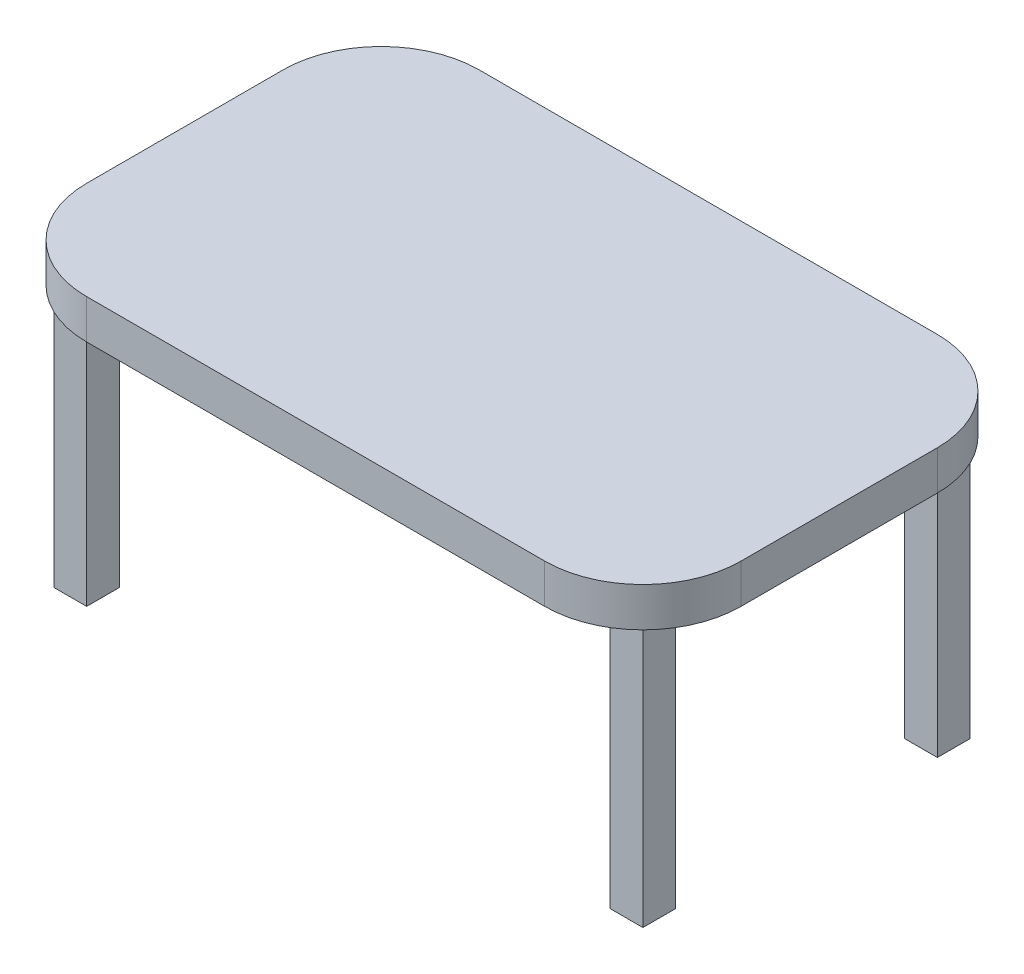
ISO-10303-21;
HEADER;
FILE_DESCRIPTION(('STEP AP214'),'2;1');
FILE_NAME('part.step','',(''),(''),'','','');
FILE_SCHEMA(('AUTOMOTIVE_DESIGN { 1 0 10303 214 1 1 1 1 }'));
ENDSEC;
DATA;
#1=APPLICATION_CONTEXT('core data for automotive mechanical design processes');
#2=APPLICATION_PROTOCOL_DEFINITION('international standard','automotive_design',2000,#1);
#3=PRODUCT_CONTEXT('',#1,'mechanical');
#4=PRODUCT('Part','Part','',(#3));
#5=PRODUCT_RELATED_PRODUCT_CATEGORY('part','',(#4));
#6=PRODUCT_DEFINITION_FORMATION('','',#4);
#7=PRODUCT_DEFINITION_CONTEXT('part definition',#1,'design');
#8=PRODUCT_DEFINITION('design','',#6,#7);
#9=PRODUCT_DEFINITION_SHAPE('','',#8);
#10=(LENGTH_UNIT() NAMED_UNIT(*) SI_UNIT(.MILLI.,.METRE.));
#11=(NAMED_UNIT(*) PLANE_ANGLE_UNIT() SI_UNIT($,.RADIAN.));
#12=(NAMED_UNIT(*) SI_UNIT($,.STERADIAN.) SOLID_ANGLE_UNIT());
#13=UNCERTAINTY_MEASURE_WITH_UNIT(LENGTH_MEASURE(1.E-05),#10,'distance_accuracy_value','');
#14=(GEOMETRIC_REPRESENTATION_CONTEXT(3) GLOBAL_UNCERTAINTY_ASSIGNED_CONTEXT((#13)) GLOBAL_UNIT_ASSIGNED_CONTEXT((#10,
#11,#12)) REPRESENTATION_CONTEXT('',''));
#15=CARTESIAN_POINT('',(0.,0.,0.));
#16=DIRECTION('',(0.,0.,1.));
#17=DIRECTION('',(1.,0.,0.));
#18=AXIS2_PLACEMENT_3D('',#15,#16,#17);
#19=CARTESIAN_POINT('',(0.,0.,0.));
#20=DIRECTION('',(0.,1.,0.));
#21=DIRECTION('',(0.,0.,1.));
#22=AXIS2_PLACEMENT_3D('',#19,#20,#21);
#23=PLANE('',#22);
#24=DIRECTION('',(1.,0.,0.));
#25=VECTOR('',#24,1.);
#26=CARTESIAN_POINT('',(-450.,0.,-200.));
#27=LINE('',#26,#25);
#28=CARTESIAN_POINT('',(-450.,0.,-200.));
#29=VERTEX_POINT('',#28);
#30=CARTESIAN_POINT('',(-400.,0.,-200.));
#31=VERTEX_POINT('',#30);
#32=EDGE_CURVE('E226',#29,#31,#27,.T.);
#33=ORIENTED_EDGE('',*,*,#32,.T.);
#34=DIRECTION('',(0.,0.,-1.));
#35=VECTOR('',#34,1.);
#36=CARTESIAN_POINT('',(-400.,0.,-250.));
#37=LINE('',#36,#35);
#38=CARTESIAN_POINT('',(-400.,0.,-250.));
#39=VERTEX_POINT('',#38);
#40=EDGE_CURVE('E200',#31,#39,#37,.T.);
#41=ORIENTED_EDGE('',*,*,#40,.T.);
#42=DIRECTION('',(-1.,0.,0.));
#43=VECTOR('',#42,1.);
#44=CARTESIAN_POINT('',(-450.,0.,-250.));
#45=LINE('',#44,#43);
#46=CARTESIAN_POINT('',(-450.,0.,-250.));
#47=VERTEX_POINT('',#46);
#48=EDGE_CURVE('E216',#39,#47,#45,.T.);
#49=ORIENTED_EDGE('',*,*,#48,.T.);
#50=DIRECTION('',(0.,0.,1.));
#51=VECTOR('',#50,1.);
#52=CARTESIAN_POINT('',(-450.,0.,-250.));
#53=LINE('',#52,#51);
#54=EDGE_CURVE('E228',#47,#29,#53,.T.);
#55=ORIENTED_EDGE('',*,*,#54,.T.);
#56=EDGE_LOOP('',(#33,#41,#49,#55));
#57=FACE_BOUND('',#56,.T.);
#58=DIRECTION('',(0.,0.,1.));
#59=VECTOR('',#58,1.);
#60=CARTESIAN_POINT('',(-400.,0.,250.));
#61=LINE('',#60,#59);
#62=CARTESIAN_POINT('',(-400.,0.,200.));
#63=VERTEX_POINT('',#62);
#64=CARTESIAN_POINT('',(-400.,0.,250.));
#65=VERTEX_POINT('',#64);
#66=EDGE_CURVE('E303',#63,#65,#61,.T.);
#67=ORIENTED_EDGE('',*,*,#66,.F.);
#68=DIRECTION('',(1.,0.,0.));
#69=VECTOR('',#68,1.);
#70=CARTESIAN_POINT('',(-450.,0.,200.));
#71=LINE('',#70,#69);
#72=CARTESIAN_POINT('',(-450.,0.,200.));
#73=VERTEX_POINT('',#72);
#74=EDGE_CURVE('E308',#73,#63,#71,.T.);
#75=ORIENTED_EDGE('',*,*,#74,.F.);
#76=DIRECTION('',(0.,0.,-1.));
#77=VECTOR('',#76,1.);
#78=CARTESIAN_POINT('',(-450.,0.,250.));
#79=LINE('',#78,#77);
#80=CARTESIAN_POINT('',(-450.,0.,250.));
#81=VERTEX_POINT('',#80);
#82=EDGE_CURVE('E320',#81,#73,#79,.T.);
#83=ORIENTED_EDGE('',*,*,#82,.F.);
#84=DIRECTION('',(-1.,0.,0.));
#85=VECTOR('',#84,1.);
#86=CARTESIAN_POINT('',(-450.,0.,250.));
#87=LINE('',#86,#85);
#88=EDGE_CURVE('E317',#65,#81,#87,.T.);
#89=ORIENTED_EDGE('',*,*,#88,.F.);
#90=EDGE_LOOP('',(#67,#75,#83,#89));
#91=FACE_BOUND('',#90,.T.);
#92=DIRECTION('',(0.,0.,-1.));
#93=VECTOR('',#92,1.);
#94=CARTESIAN_POINT('',(500.,0.,300.));
#95=LINE('',#94,#93);
#96=CARTESIAN_POINT('',(500.,0.,150.));
#97=VERTEX_POINT('',#96);
#98=CARTESIAN_POINT('',(500.,0.,-150.));
#99=VERTEX_POINT('',#98);
#100=EDGE_CURVE('E354',#97,#99,#95,.T.);
#101=ORIENTED_EDGE('',*,*,#100,.F.);
#102=CARTESIAN_POINT('',(350.,0.,150.));
#103=DIRECTION('',(0.,1.,0.));
#104=DIRECTION('',(0.,0.,1.));
#105=AXIS2_PLACEMENT_3D('',#102,#103,#104);
#106=CIRCLE('',#105,150.);
#107=CARTESIAN_POINT('',(350.,0.,300.));
#108=VERTEX_POINT('',#107);
#109=EDGE_CURVE('E368',#97,#108,#106,.F.);
#110=ORIENTED_EDGE('',*,*,#109,.T.);
#111=DIRECTION('',(1.,0.,0.));
#112=VECTOR('',#111,1.);
#113=CARTESIAN_POINT('',(500.,0.,300.));
#114=LINE('',#113,#112);
#115=CARTESIAN_POINT('',(-350.,0.,300.));
#116=VERTEX_POINT('',#115);
#117=EDGE_CURVE('E351',#116,#108,#114,.T.);
#118=ORIENTED_EDGE('',*,*,#117,.F.);
#119=CARTESIAN_POINT('',(-350.,0.,150.));
#120=DIRECTION('',(0.,1.,0.));
#121=DIRECTION('',(0.,0.,1.));
#122=AXIS2_PLACEMENT_3D('',#119,#120,#121);
#123=CIRCLE('',#122,150.);
#124=CARTESIAN_POINT('',(-500.,0.,150.));
#125=VERTEX_POINT('',#124);
#126=EDGE_CURVE('E364',#116,#125,#123,.F.);
#127=ORIENTED_EDGE('',*,*,#126,.T.);
#128=DIRECTION('',(0.,0.,1.));
#129=VECTOR('',#128,1.);
#130=CARTESIAN_POINT('',(-500.,0.,300.));
#131=LINE('',#130,#129);
#132=CARTESIAN_POINT('',(-500.,0.,-150.));
#133=VERTEX_POINT('',#132);
#134=EDGE_CURVE('E336',#133,#125,#131,.T.);
#135=ORIENTED_EDGE('',*,*,#134,.F.);
#136=CARTESIAN_POINT('',(-350.,0.,-150.));
#137=DIRECTION('',(0.,1.,0.));
#138=DIRECTION('',(0.,0.,1.));
#139=AXIS2_PLACEMENT_3D('',#136,#137,#138);
#140=CIRCLE('',#139,150.);
#141=CARTESIAN_POINT('',(-350.,0.,-300.));
#142=VERTEX_POINT('',#141);
#143=EDGE_CURVE('E362',#133,#142,#140,.F.);
#144=ORIENTED_EDGE('',*,*,#143,.T.);
#145=DIRECTION('',(-1.,0.,0.));
#146=VECTOR('',#145,1.);
#147=CARTESIAN_POINT('',(500.,0.,-300.));
#148=LINE('',#147,#146);
#149=CARTESIAN_POINT('',(350.,0.,-300.));
#150=VERTEX_POINT('',#149);
#151=EDGE_CURVE('E341',#150,#142,#148,.T.);
#152=ORIENTED_EDGE('',*,*,#151,.F.);
#153=CARTESIAN_POINT('',(350.,0.,-150.));
#154=DIRECTION('',(0.,1.,0.));
#155=DIRECTION('',(0.,0.,1.));
#156=AXIS2_PLACEMENT_3D('',#153,#154,#155);
#157=CIRCLE('',#156,150.);
#158=EDGE_CURVE('E366',#150,#99,#157,.F.);
#159=ORIENTED_EDGE('',*,*,#158,.T.);
#160=EDGE_LOOP('',(#101,#110,#118,#127,#135,#144,#152,#159));
#161=FACE_BOUND('',#160,.T.);
#162=DIRECTION('',(-1.,0.,0.));
#163=VECTOR('',#162,1.);
#164=CARTESIAN_POINT('',(450.,0.,200.));
#165=LINE('',#164,#163);
#166=CARTESIAN_POINT('',(450.,0.,200.));
#167=VERTEX_POINT('',#166);
#168=CARTESIAN_POINT('',(400.,0.,200.));
#169=VERTEX_POINT('',#168);
#170=EDGE_CURVE('E287',#167,#169,#165,.T.);
#171=ORIENTED_EDGE('',*,*,#170,.T.);
#172=DIRECTION('',(0.,0.,1.));
#173=VECTOR('',#172,1.);
#174=CARTESIAN_POINT('',(400.,0.,250.));
#175=LINE('',#174,#173);
#176=CARTESIAN_POINT('',(400.,0.,250.));
#177=VERTEX_POINT('',#176);
#178=EDGE_CURVE('E270',#169,#177,#175,.T.);
#179=ORIENTED_EDGE('',*,*,#178,.T.);
#180=DIRECTION('',(1.,0.,0.));
#181=VECTOR('',#180,1.);
#182=CARTESIAN_POINT('',(450.,0.,250.));
#183=LINE('',#182,#181);
#184=CARTESIAN_POINT('',(450.,0.,250.));
#185=VERTEX_POINT('',#184);
#186=EDGE_CURVE('E275',#177,#185,#183,.T.);
#187=ORIENTED_EDGE('',*,*,#186,.T.);
#188=DIRECTION('',(0.,0.,-1.));
#189=VECTOR('',#188,1.);
#190=CARTESIAN_POINT('',(450.,0.,250.));
#191=LINE('',#190,#189);
#192=EDGE_CURVE('E290',#185,#167,#191,.T.);
#193=ORIENTED_EDGE('',*,*,#192,.T.);
#194=EDGE_LOOP('',(#171,#179,#187,#193));
#195=FACE_BOUND('',#194,.T.);
#196=DIRECTION('',(0.,0.,-1.));
#197=VECTOR('',#196,1.);
#198=CARTESIAN_POINT('',(400.,0.,-250.));
#199=LINE('',#198,#197);
#200=CARTESIAN_POINT('',(400.,0.,-200.));
#201=VERTEX_POINT('',#200);
#202=CARTESIAN_POINT('',(400.,0.,-250.));
#203=VERTEX_POINT('',#202);
#204=EDGE_CURVE('E205',#201,#203,#199,.T.);
#205=ORIENTED_EDGE('',*,*,#204,.F.);
#206=DIRECTION('',(-1.,0.,0.));
#207=VECTOR('',#206,1.);
#208=CARTESIAN_POINT('',(450.,0.,-200.));
#209=LINE('',#208,#207);
#210=CARTESIAN_POINT('',(450.,0.,-200.));
#211=VERTEX_POINT('',#210);
#212=EDGE_CURVE('E242',#211,#201,#209,.T.);
#213=ORIENTED_EDGE('',*,*,#212,.F.);
#214=DIRECTION('',(0.,0.,1.));
#215=VECTOR('',#214,1.);
#216=CARTESIAN_POINT('',(450.,0.,-250.));
#217=LINE('',#216,#215);
#218=CARTESIAN_POINT('',(450.,0.,-250.));
#219=VERTEX_POINT('',#218);
#220=EDGE_CURVE('E254',#219,#211,#217,.T.);
#221=ORIENTED_EDGE('',*,*,#220,.F.);
#222=DIRECTION('',(1.,0.,0.));
#223=VECTOR('',#222,1.);
#224=CARTESIAN_POINT('',(450.,0.,-250.));
#225=LINE('',#224,#223);
#226=EDGE_CURVE('E251',#203,#219,#225,.T.);
#227=ORIENTED_EDGE('',*,*,#226,.F.);
#228=EDGE_LOOP('',(#205,#213,#221,#227));
#229=FACE_BOUND('',#228,.T.);
#230=ADVANCED_FACE('F32',(#57,#91,#161,#195,#229),#23,.F.);
#231=CARTESIAN_POINT('',(-500.,60.,300.));
#232=DIRECTION('',(1.,0.,0.));
#233=DIRECTION('',(0.,0.,-1.));
#234=AXIS2_PLACEMENT_3D('',#231,#232,#233);
#235=PLANE('',#234);
#236=ORIENTED_EDGE('',*,*,#134,.T.);
#237=DIRECTION('',(0.,-1.,0.));
#238=VECTOR('',#237,1.);
#239=CARTESIAN_POINT('',(-500.,60.,150.));
#240=LINE('',#239,#238);
#241=CARTESIAN_POINT('',(-500.,60.,150.));
#242=VERTEX_POINT('',#241);
#243=EDGE_CURVE('E11',#125,#242,#240,.F.);
#244=ORIENTED_EDGE('',*,*,#243,.T.);
#245=DIRECTION('',(0.,0.,1.));
#246=VECTOR('',#245,1.);
#247=CARTESIAN_POINT('',(-500.,60.,300.));
#248=LINE('',#247,#246);
#249=CARTESIAN_POINT('',(-500.,60.,-150.));
#250=VERTEX_POINT('',#249);
#251=EDGE_CURVE('E337',#250,#242,#248,.T.);
#252=ORIENTED_EDGE('',*,*,#251,.F.);
#253=DIRECTION('',(0.,-1.,0.));
#254=VECTOR('',#253,1.);
#255=CARTESIAN_POINT('',(-500.,60.,-150.));
#256=LINE('',#255,#254);
#257=EDGE_CURVE('E40',#250,#133,#256,.T.);
#258=ORIENTED_EDGE('',*,*,#257,.T.);
#259=EDGE_LOOP('',(#236,#244,#252,#258));
#260=FACE_BOUND('',#259,.T.);
#261=ADVANCED_FACE('F390',(#260),#235,.F.);
#262=CARTESIAN_POINT('',(500.,60.,300.));
#263=DIRECTION('',(0.,0.,-1.));
#264=DIRECTION('',(-1.,0.,0.));
#265=AXIS2_PLACEMENT_3D('',#262,#263,#264);
#266=PLANE('',#265);
#267=ORIENTED_EDGE('',*,*,#117,.T.);
#268=DIRECTION('',(0.,-1.,0.));
#269=VECTOR('',#268,1.);
#270=CARTESIAN_POINT('',(350.,60.,300.));
#271=LINE('',#270,#269);
#272=CARTESIAN_POINT('',(350.,60.,300.));
#273=VERTEX_POINT('',#272);
#274=EDGE_CURVE('E373',#108,#273,#271,.F.);
#275=ORIENTED_EDGE('',*,*,#274,.T.);
#276=DIRECTION('',(1.,0.,0.));
#277=VECTOR('',#276,1.);
#278=CARTESIAN_POINT('',(500.,60.,300.));
#279=LINE('',#278,#277);
#280=CARTESIAN_POINT('',(-350.,60.,300.));
#281=VERTEX_POINT('',#280);
#282=EDGE_CURVE('E340',#281,#273,#279,.T.);
#283=ORIENTED_EDGE('',*,*,#282,.F.);
#284=DIRECTION('',(0.,-1.,0.));
#285=VECTOR('',#284,1.);
#286=CARTESIAN_POINT('',(-350.,60.,300.));
#287=LINE('',#286,#285);
#288=EDGE_CURVE('E370',#281,#116,#287,.T.);
#289=ORIENTED_EDGE('',*,*,#288,.T.);
#290=EDGE_LOOP('',(#267,#275,#283,#289));
#291=FACE_BOUND('',#290,.T.);
#292=ADVANCED_FACE('F405',(#291),#266,.F.);
#293=CARTESIAN_POINT('',(500.,60.,300.));
#294=DIRECTION('',(-1.,0.,0.));
#295=DIRECTION('',(0.,0.,1.));
#296=AXIS2_PLACEMENT_3D('',#293,#294,#295);
#297=PLANE('',#296);
#298=DIRECTION('',(0.,0.,-1.));
#299=VECTOR('',#298,1.);
#300=CARTESIAN_POINT('',(500.,60.,300.));
#301=LINE('',#300,#299);
#302=CARTESIAN_POINT('',(500.,60.,150.));
#303=VERTEX_POINT('',#302);
#304=CARTESIAN_POINT('',(500.,60.,-150.));
#305=VERTEX_POINT('',#304);
#306=EDGE_CURVE('E344',#303,#305,#301,.T.);
#307=ORIENTED_EDGE('',*,*,#306,.F.);
#308=DIRECTION('',(0.,-1.,0.));
#309=VECTOR('',#308,1.);
#310=CARTESIAN_POINT('',(500.,60.,150.));
#311=LINE('',#310,#309);
#312=EDGE_CURVE('E359',#303,#97,#311,.T.);
#313=ORIENTED_EDGE('',*,*,#312,.T.);
#314=ORIENTED_EDGE('',*,*,#100,.T.);
#315=DIRECTION('',(0.,-1.,0.));
#316=VECTOR('',#315,1.);
#317=CARTESIAN_POINT('',(500.,60.,-150.));
#318=LINE('',#317,#316);
#319=EDGE_CURVE('E348',#99,#305,#318,.F.);
#320=ORIENTED_EDGE('',*,*,#319,.T.);
#321=EDGE_LOOP('',(#307,#313,#314,#320));
#322=FACE_BOUND('',#321,.T.);
#323=ADVANCED_FACE('F414',(#322),#297,.F.);
#324=CARTESIAN_POINT('',(500.,60.,-300.));
#325=DIRECTION('',(0.,0.,1.));
#326=DIRECTION('',(1.,0.,0.));
#327=AXIS2_PLACEMENT_3D('',#324,#325,#326);
#328=PLANE('',#327);
#329=DIRECTION('',(-1.,0.,0.));
#330=VECTOR('',#329,1.);
#331=CARTESIAN_POINT('',(500.,60.,-300.));
#332=LINE('',#331,#330);
#333=CARTESIAN_POINT('',(350.,60.,-300.));
#334=VERTEX_POINT('',#333);
#335=CARTESIAN_POINT('',(-350.,60.,-300.));
#336=VERTEX_POINT('',#335);
#337=EDGE_CURVE('E346',#334,#336,#332,.T.);
#338=ORIENTED_EDGE('',*,*,#337,.F.);
#339=DIRECTION('',(0.,-1.,0.));
#340=VECTOR('',#339,1.);
#341=CARTESIAN_POINT('',(350.,60.,-300.));
#342=LINE('',#341,#340);
#343=EDGE_CURVE('E383',#334,#150,#342,.T.);
#344=ORIENTED_EDGE('',*,*,#343,.T.);
#345=ORIENTED_EDGE('',*,*,#151,.T.);
#346=DIRECTION('',(0.,-1.,0.));
#347=VECTOR('',#346,1.);
#348=CARTESIAN_POINT('',(-350.,60.,-300.));
#349=LINE('',#348,#347);
#350=EDGE_CURVE('E47',#142,#336,#349,.F.);
#351=ORIENTED_EDGE('',*,*,#350,.T.);
#352=EDGE_LOOP('',(#338,#344,#345,#351));
#353=FACE_BOUND('',#352,.T.);
#354=ADVANCED_FACE('F419',(#353),#328,.F.);
#355=CARTESIAN_POINT('',(0.,60.,0.));
#356=DIRECTION('',(0.,1.,0.));
#357=DIRECTION('',(0.,0.,1.));
#358=AXIS2_PLACEMENT_3D('',#355,#356,#357);
#359=PLANE('',#358);
#360=ORIENTED_EDGE('',*,*,#282,.T.);
#361=CARTESIAN_POINT('',(350.,60.,150.));
#362=DIRECTION('',(0.,1.,0.));
#363=DIRECTION('',(0.,0.,1.));
#364=AXIS2_PLACEMENT_3D('',#361,#362,#363);
#365=CIRCLE('',#364,150.);
#366=EDGE_CURVE('E380',#273,#303,#365,.T.);
#367=ORIENTED_EDGE('',*,*,#366,.T.);
#368=ORIENTED_EDGE('',*,*,#306,.T.);
#369=CARTESIAN_POINT('',(350.,60.,-150.));
#370=DIRECTION('',(0.,1.,0.));
#371=DIRECTION('',(0.,0.,1.));
#372=AXIS2_PLACEMENT_3D('',#369,#370,#371);
#373=CIRCLE('',#372,150.);
#374=EDGE_CURVE('E54',#305,#334,#373,.T.);
#375=ORIENTED_EDGE('',*,*,#374,.T.);
#376=ORIENTED_EDGE('',*,*,#337,.T.);
#377=CARTESIAN_POINT('',(-350.,60.,-150.));
#378=DIRECTION('',(0.,1.,0.));
#379=DIRECTION('',(0.,0.,1.));
#380=AXIS2_PLACEMENT_3D('',#377,#378,#379);
#381=CIRCLE('',#380,150.);
#382=EDGE_CURVE('E375',#336,#250,#381,.T.);
#383=ORIENTED_EDGE('',*,*,#382,.T.);
#384=ORIENTED_EDGE('',*,*,#251,.T.);
#385=CARTESIAN_POINT('',(-350.,60.,150.));
#386=DIRECTION('',(0.,1.,0.));
#387=DIRECTION('',(0.,0.,1.));
#388=AXIS2_PLACEMENT_3D('',#385,#386,#387);
#389=CIRCLE('',#388,150.);
#390=EDGE_CURVE('E377',#242,#281,#389,.T.);
#391=ORIENTED_EDGE('',*,*,#390,.T.);
#392=EDGE_LOOP('',(#360,#367,#368,#375,#376,#383,#384,#391));
#393=FACE_BOUND('',#392,.T.);
#394=ADVANCED_FACE('F408',(#393),#359,.T.);
#395=CARTESIAN_POINT('',(-400.,-400.,250.));
#396=DIRECTION('',(-1.,0.,0.));
#397=DIRECTION('',(0.,0.,1.));
#398=AXIS2_PLACEMENT_3D('',#395,#396,#397);
#399=PLANE('',#398);
#400=ORIENTED_EDGE('',*,*,#66,.T.);
#401=DIRECTION('',(0.,1.,0.));
#402=VECTOR('',#401,1.);
#403=CARTESIAN_POINT('',(-400.,-400.,250.));
#404=LINE('',#403,#402);
#405=CARTESIAN_POINT('',(-400.,-400.,250.));
#406=VERTEX_POINT('',#405);
#407=EDGE_CURVE('E333',#406,#65,#404,.T.);
#408=ORIENTED_EDGE('',*,*,#407,.F.);
#409=DIRECTION('',(0.,0.,1.));
#410=VECTOR('',#409,1.);
#411=CARTESIAN_POINT('',(-400.,-400.,250.));
#412=LINE('',#411,#410);
#413=CARTESIAN_POINT('',(-400.,-400.,200.));
#414=VERTEX_POINT('',#413);
#415=EDGE_CURVE('E304',#414,#406,#412,.T.);
#416=ORIENTED_EDGE('',*,*,#415,.F.);
#417=DIRECTION('',(0.,1.,0.));
#418=VECTOR('',#417,1.);
#419=CARTESIAN_POINT('',(-400.,-400.,200.));
#420=LINE('',#419,#418);
#421=EDGE_CURVE('E314',#414,#63,#420,.T.);
#422=ORIENTED_EDGE('',*,*,#421,.T.);
#423=EDGE_LOOP('',(#400,#408,#416,#422));
#424=FACE_BOUND('',#423,.T.);
#425=ADVANCED_FACE('F635',(#424),#399,.F.);
#426=CARTESIAN_POINT('',(-450.,-400.,250.));
#427=DIRECTION('',(0.,0.,-1.));
#428=DIRECTION('',(-1.,0.,0.));
#429=AXIS2_PLACEMENT_3D('',#426,#427,#428);
#430=PLANE('',#429);
#431=ORIENTED_EDGE('',*,*,#88,.T.);
#432=DIRECTION('',(0.,1.,0.));
#433=VECTOR('',#432,1.);
#434=CARTESIAN_POINT('',(-450.,-400.,250.));
#435=LINE('',#434,#433);
#436=CARTESIAN_POINT('',(-450.,-400.,250.));
#437=VERTEX_POINT('',#436);
#438=EDGE_CURVE('E330',#437,#81,#435,.T.);
#439=ORIENTED_EDGE('',*,*,#438,.F.);
#440=DIRECTION('',(-1.,0.,0.));
#441=VECTOR('',#440,1.);
#442=CARTESIAN_POINT('',(-450.,-400.,250.));
#443=LINE('',#442,#441);
#444=EDGE_CURVE('E307',#406,#437,#443,.T.);
#445=ORIENTED_EDGE('',*,*,#444,.F.);
#446=ORIENTED_EDGE('',*,*,#407,.T.);
#447=EDGE_LOOP('',(#431,#439,#445,#446));
#448=FACE_BOUND('',#447,.T.);
#449=ADVANCED_FACE('F626',(#448),#430,.F.);
#450=CARTESIAN_POINT('',(-450.,-400.,250.));
#451=DIRECTION('',(1.,0.,0.));
#452=DIRECTION('',(0.,0.,-1.));
#453=AXIS2_PLACEMENT_3D('',#450,#451,#452);
#454=PLANE('',#453);
#455=ORIENTED_EDGE('',*,*,#82,.T.);
#456=DIRECTION('',(0.,1.,0.));
#457=VECTOR('',#456,1.);
#458=CARTESIAN_POINT('',(-450.,-400.,200.));
#459=LINE('',#458,#457);
#460=CARTESIAN_POINT('',(-450.,-400.,200.));
#461=VERTEX_POINT('',#460);
#462=EDGE_CURVE('E327',#461,#73,#459,.T.);
#463=ORIENTED_EDGE('',*,*,#462,.F.);
#464=DIRECTION('',(0.,0.,-1.));
#465=VECTOR('',#464,1.);
#466=CARTESIAN_POINT('',(-450.,-400.,250.));
#467=LINE('',#466,#465);
#468=EDGE_CURVE('E310',#437,#461,#467,.T.);
#469=ORIENTED_EDGE('',*,*,#468,.F.);
#470=ORIENTED_EDGE('',*,*,#438,.T.);
#471=EDGE_LOOP('',(#455,#463,#469,#470));
#472=FACE_BOUND('',#471,.T.);
#473=ADVANCED_FACE('F617',(#472),#454,.F.);
#474=CARTESIAN_POINT('',(-450.,-400.,200.));
#475=DIRECTION('',(0.,0.,1.));
#476=DIRECTION('',(1.,0.,0.));
#477=AXIS2_PLACEMENT_3D('',#474,#475,#476);
#478=PLANE('',#477);
#479=ORIENTED_EDGE('',*,*,#74,.T.);
#480=ORIENTED_EDGE('',*,*,#421,.F.);
#481=DIRECTION('',(1.,0.,0.));
#482=VECTOR('',#481,1.);
#483=CARTESIAN_POINT('',(-450.,-400.,200.));
#484=LINE('',#483,#482);
#485=EDGE_CURVE('E312',#461,#414,#484,.T.);
#486=ORIENTED_EDGE('',*,*,#485,.F.);
#487=ORIENTED_EDGE('',*,*,#462,.T.);
#488=EDGE_LOOP('',(#479,#480,#486,#487));
#489=FACE_BOUND('',#488,.T.);
#490=ADVANCED_FACE('F608',(#489),#478,.F.);
#491=CARTESIAN_POINT('',(0.,-400.,0.));
#492=DIRECTION('',(0.,-1.,0.));
#493=DIRECTION('',(0.,0.,-1.));
#494=AXIS2_PLACEMENT_3D('',#491,#492,#493);
#495=PLANE('',#494);
#496=ORIENTED_EDGE('',*,*,#415,.T.);
#497=ORIENTED_EDGE('',*,*,#444,.T.);
#498=ORIENTED_EDGE('',*,*,#468,.T.);
#499=ORIENTED_EDGE('',*,*,#485,.T.);
#500=EDGE_LOOP('',(#496,#497,#498,#499));
#501=FACE_BOUND('',#500,.T.);
#502=ADVANCED_FACE('F599',(#501),#495,.T.);
#503=CARTESIAN_POINT('',(400.,-400.,250.));
#504=DIRECTION('',(-1.,0.,0.));
#505=DIRECTION('',(0.,0.,1.));
#506=AXIS2_PLACEMENT_3D('',#503,#504,#505);
#507=PLANE('',#506);
#508=ORIENTED_EDGE('',*,*,#178,.F.);
#509=DIRECTION('',(0.,1.,0.));
#510=VECTOR('',#509,1.);
#511=CARTESIAN_POINT('',(400.,-400.,200.));
#512=LINE('',#511,#510);
#513=CARTESIAN_POINT('',(400.,-400.,200.));
#514=VERTEX_POINT('',#513);
#515=EDGE_CURVE('E301',#514,#169,#512,.T.);
#516=ORIENTED_EDGE('',*,*,#515,.F.);
#517=DIRECTION('',(0.,0.,1.));
#518=VECTOR('',#517,1.);
#519=CARTESIAN_POINT('',(400.,-400.,250.));
#520=LINE('',#519,#518);
#521=CARTESIAN_POINT('',(400.,-400.,250.));
#522=VERTEX_POINT('',#521);
#523=EDGE_CURVE('E271',#514,#522,#520,.T.);
#524=ORIENTED_EDGE('',*,*,#523,.T.);
#525=DIRECTION('',(0.,1.,0.));
#526=VECTOR('',#525,1.);
#527=CARTESIAN_POINT('',(400.,-400.,250.));
#528=LINE('',#527,#526);
#529=EDGE_CURVE('E284',#522,#177,#528,.T.);
#530=ORIENTED_EDGE('',*,*,#529,.T.);
#531=EDGE_LOOP('',(#508,#516,#524,#530));
#532=FACE_BOUND('',#531,.T.);
#533=ADVANCED_FACE('F590',(#532),#507,.T.);
#534=CARTESIAN_POINT('',(450.,-400.,200.));
#535=DIRECTION('',(0.,0.,-1.));
#536=DIRECTION('',(-1.,0.,0.));
#537=AXIS2_PLACEMENT_3D('',#534,#535,#536);
#538=PLANE('',#537);
#539=ORIENTED_EDGE('',*,*,#170,.F.);
#540=DIRECTION('',(0.,1.,0.));
#541=VECTOR('',#540,1.);
#542=CARTESIAN_POINT('',(450.,-400.,200.));
#543=LINE('',#542,#541);
#544=CARTESIAN_POINT('',(450.,-400.,200.));
#545=VERTEX_POINT('',#544);
#546=EDGE_CURVE('E299',#545,#167,#543,.T.);
#547=ORIENTED_EDGE('',*,*,#546,.F.);
#548=DIRECTION('',(-1.,0.,0.));
#549=VECTOR('',#548,1.);
#550=CARTESIAN_POINT('',(450.,-400.,200.));
#551=LINE('',#550,#549);
#552=EDGE_CURVE('E274',#545,#514,#551,.T.);
#553=ORIENTED_EDGE('',*,*,#552,.T.);
#554=ORIENTED_EDGE('',*,*,#515,.T.);
#555=EDGE_LOOP('',(#539,#547,#553,#554));
#556=FACE_BOUND('',#555,.T.);
#557=ADVANCED_FACE('F581',(#556),#538,.T.);
#558=CARTESIAN_POINT('',(450.,-400.,250.));
#559=DIRECTION('',(1.,0.,0.));
#560=DIRECTION('',(0.,0.,-1.));
#561=AXIS2_PLACEMENT_3D('',#558,#559,#560);
#562=PLANE('',#561);
#563=ORIENTED_EDGE('',*,*,#192,.F.);
#564=DIRECTION('',(0.,1.,0.));
#565=VECTOR('',#564,1.);
#566=CARTESIAN_POINT('',(450.,-400.,250.));
#567=LINE('',#566,#565);
#568=CARTESIAN_POINT('',(450.,-400.,250.));
#569=VERTEX_POINT('',#568);
#570=EDGE_CURVE('E296',#569,#185,#567,.T.);
#571=ORIENTED_EDGE('',*,*,#570,.F.);
#572=DIRECTION('',(0.,0.,-1.));
#573=VECTOR('',#572,1.);
#574=CARTESIAN_POINT('',(450.,-400.,250.));
#575=LINE('',#574,#573);
#576=EDGE_CURVE('E278',#569,#545,#575,.T.);
#577=ORIENTED_EDGE('',*,*,#576,.T.);
#578=ORIENTED_EDGE('',*,*,#546,.T.);
#579=EDGE_LOOP('',(#563,#571,#577,#578));
#580=FACE_BOUND('',#579,.T.);
#581=ADVANCED_FACE('F572',(#580),#562,.T.);
#582=CARTESIAN_POINT('',(450.,-400.,250.));
#583=DIRECTION('',(0.,0.,1.));
#584=DIRECTION('',(1.,0.,0.));
#585=AXIS2_PLACEMENT_3D('',#582,#583,#584);
#586=PLANE('',#585);
#587=ORIENTED_EDGE('',*,*,#186,.F.);
#588=ORIENTED_EDGE('',*,*,#529,.F.);
#589=DIRECTION('',(1.,0.,0.));
#590=VECTOR('',#589,1.);
#591=CARTESIAN_POINT('',(450.,-400.,250.));
#592=LINE('',#591,#590);
#593=EDGE_CURVE('E281',#522,#569,#592,.T.);
#594=ORIENTED_EDGE('',*,*,#593,.T.);
#595=ORIENTED_EDGE('',*,*,#570,.T.);
#596=EDGE_LOOP('',(#587,#588,#594,#595));
#597=FACE_BOUND('',#596,.T.);
#598=ADVANCED_FACE('F563',(#597),#586,.T.);
#599=CARTESIAN_POINT('',(0.,-400.,0.));
#600=DIRECTION('',(0.,-1.,0.));
#601=DIRECTION('',(0.,0.,-1.));
#602=AXIS2_PLACEMENT_3D('',#599,#600,#601);
#603=PLANE('',#602);
#604=ORIENTED_EDGE('',*,*,#523,.F.);
#605=ORIENTED_EDGE('',*,*,#552,.F.);
#606=ORIENTED_EDGE('',*,*,#576,.F.);
#607=ORIENTED_EDGE('',*,*,#593,.F.);
#608=EDGE_LOOP('',(#604,#605,#606,#607));
#609=FACE_BOUND('',#608,.T.);
#610=ADVANCED_FACE('F549',(#609),#603,.T.);
#611=CARTESIAN_POINT('',(400.,-400.,-250.));
#612=DIRECTION('',(1.,0.,0.));
#613=DIRECTION('',(0.,0.,-1.));
#614=AXIS2_PLACEMENT_3D('',#611,#612,#613);
#615=PLANE('',#614);
#616=ORIENTED_EDGE('',*,*,#204,.T.);
#617=DIRECTION('',(0.,1.,0.));
#618=VECTOR('',#617,1.);
#619=CARTESIAN_POINT('',(400.,-400.,-250.));
#620=LINE('',#619,#618);
#621=CARTESIAN_POINT('',(400.,-400.,-250.));
#622=VERTEX_POINT('',#621);
#623=EDGE_CURVE('E267',#622,#203,#620,.T.);
#624=ORIENTED_EDGE('',*,*,#623,.F.);
#625=DIRECTION('',(0.,0.,-1.));
#626=VECTOR('',#625,1.);
#627=CARTESIAN_POINT('',(400.,-400.,-250.));
#628=LINE('',#627,#626);
#629=CARTESIAN_POINT('',(400.,-400.,-200.));
#630=VERTEX_POINT('',#629);
#631=EDGE_CURVE('E238',#630,#622,#628,.T.);
#632=ORIENTED_EDGE('',*,*,#631,.F.);
#633=DIRECTION('',(0.,1.,0.));
#634=VECTOR('',#633,1.);
#635=CARTESIAN_POINT('',(400.,-400.,-200.));
#636=LINE('',#635,#634);
#637=EDGE_CURVE('E248',#630,#201,#636,.T.);
#638=ORIENTED_EDGE('',*,*,#637,.T.);
#639=EDGE_LOOP('',(#616,#624,#632,#638));
#640=FACE_BOUND('',#639,.T.);
#641=ADVANCED_FACE('F540',(#640),#615,.F.);
#642=CARTESIAN_POINT('',(450.,-400.,-250.));
#643=DIRECTION('',(0.,0.,1.));
#644=DIRECTION('',(1.,0.,0.));
#645=AXIS2_PLACEMENT_3D('',#642,#643,#644);
#646=PLANE('',#645);
#647=ORIENTED_EDGE('',*,*,#226,.T.);
#648=DIRECTION('',(0.,1.,0.));
#649=VECTOR('',#648,1.);
#650=CARTESIAN_POINT('',(450.,-400.,-250.));
#651=LINE('',#650,#649);
#652=CARTESIAN_POINT('',(450.,-400.,-250.));
#653=VERTEX_POINT('',#652);
#654=EDGE_CURVE('E264',#653,#219,#651,.T.);
#655=ORIENTED_EDGE('',*,*,#654,.F.);
#656=DIRECTION('',(1.,0.,0.));
#657=VECTOR('',#656,1.);
#658=CARTESIAN_POINT('',(450.,-400.,-250.));
#659=LINE('',#658,#657);
#660=EDGE_CURVE('E241',#622,#653,#659,.T.);
#661=ORIENTED_EDGE('',*,*,#660,.F.);
#662=ORIENTED_EDGE('',*,*,#623,.T.);
#663=EDGE_LOOP('',(#647,#655,#661,#662));
#664=FACE_BOUND('',#663,.T.);
#665=ADVANCED_FACE('F531',(#664),#646,.F.);
#666=CARTESIAN_POINT('',(450.,-400.,-250.));
#667=DIRECTION('',(-1.,0.,0.));
#668=DIRECTION('',(0.,0.,1.));
#669=AXIS2_PLACEMENT_3D('',#666,#667,#668);
#670=PLANE('',#669);
#671=ORIENTED_EDGE('',*,*,#220,.T.);
#672=DIRECTION('',(0.,1.,0.));
#673=VECTOR('',#672,1.);
#674=CARTESIAN_POINT('',(450.,-400.,-200.));
#675=LINE('',#674,#673);
#676=CARTESIAN_POINT('',(450.,-400.,-200.));
#677=VERTEX_POINT('',#676);
#678=EDGE_CURVE('E261',#677,#211,#675,.T.);
#679=ORIENTED_EDGE('',*,*,#678,.F.);
#680=DIRECTION('',(0.,0.,1.));
#681=VECTOR('',#680,1.);
#682=CARTESIAN_POINT('',(450.,-400.,-250.));
#683=LINE('',#682,#681);
#684=EDGE_CURVE('E244',#653,#677,#683,.T.);
#685=ORIENTED_EDGE('',*,*,#684,.F.);
#686=ORIENTED_EDGE('',*,*,#654,.T.);
#687=EDGE_LOOP('',(#671,#679,#685,#686));
#688=FACE_BOUND('',#687,.T.);
#689=ADVANCED_FACE('F522',(#688),#670,.F.);
#690=CARTESIAN_POINT('',(450.,-400.,-200.));
#691=DIRECTION('',(0.,0.,-1.));
#692=DIRECTION('',(-1.,0.,0.));
#693=AXIS2_PLACEMENT_3D('',#690,#691,#692);
#694=PLANE('',#693);
#695=ORIENTED_EDGE('',*,*,#212,.T.);
#696=ORIENTED_EDGE('',*,*,#637,.F.);
#697=DIRECTION('',(-1.,0.,0.));
#698=VECTOR('',#697,1.);
#699=CARTESIAN_POINT('',(450.,-400.,-200.));
#700=LINE('',#699,#698);
#701=EDGE_CURVE('E246',#677,#630,#700,.T.);
#702=ORIENTED_EDGE('',*,*,#701,.F.);
#703=ORIENTED_EDGE('',*,*,#678,.T.);
#704=EDGE_LOOP('',(#695,#696,#702,#703));
#705=FACE_BOUND('',#704,.T.);
#706=ADVANCED_FACE('F513',(#705),#694,.F.);
#707=CARTESIAN_POINT('',(0.,-400.,0.));
#708=DIRECTION('',(0.,-1.,0.));
#709=DIRECTION('',(0.,0.,1.));
#710=AXIS2_PLACEMENT_3D('',#707,#708,#709);
#711=PLANE('',#710);
#712=ORIENTED_EDGE('',*,*,#631,.T.);
#713=ORIENTED_EDGE('',*,*,#660,.T.);
#714=ORIENTED_EDGE('',*,*,#684,.T.);
#715=ORIENTED_EDGE('',*,*,#701,.T.);
#716=EDGE_LOOP('',(#712,#713,#714,#715));
#717=FACE_BOUND('',#716,.T.);
#718=ADVANCED_FACE('F505',(#717),#711,.T.);
#719=CARTESIAN_POINT('',(-400.,-400.,-250.));
#720=DIRECTION('',(1.,0.,0.));
#721=DIRECTION('',(0.,0.,-1.));
#722=AXIS2_PLACEMENT_3D('',#719,#720,#721);
#723=PLANE('',#722);
#724=ORIENTED_EDGE('',*,*,#40,.F.);
#725=DIRECTION('',(0.,1.,0.));
#726=VECTOR('',#725,1.);
#727=CARTESIAN_POINT('',(-400.,-400.,-200.));
#728=LINE('',#727,#726);
#729=CARTESIAN_POINT('',(-400.,-400.,-200.));
#730=VERTEX_POINT('',#729);
#731=EDGE_CURVE('E194',#730,#31,#728,.T.);
#732=ORIENTED_EDGE('',*,*,#731,.F.);
#733=DIRECTION('',(0.,0.,-1.));
#734=VECTOR('',#733,1.);
#735=CARTESIAN_POINT('',(-400.,-400.,-250.));
#736=LINE('',#735,#734);
#737=CARTESIAN_POINT('',(-400.,-400.,-250.));
#738=VERTEX_POINT('',#737);
#739=EDGE_CURVE('E197',#730,#738,#736,.T.);
#740=ORIENTED_EDGE('',*,*,#739,.T.);
#741=DIRECTION('',(0.,1.,0.));
#742=VECTOR('',#741,1.);
#743=CARTESIAN_POINT('',(-400.,-400.,-250.));
#744=LINE('',#743,#742);
#745=EDGE_CURVE('E224',#738,#39,#744,.T.);
#746=ORIENTED_EDGE('',*,*,#745,.T.);
#747=EDGE_LOOP('',(#724,#732,#740,#746));
#748=FACE_BOUND('',#747,.T.);
#749=ADVANCED_FACE('F196',(#748),#723,.T.);
#750=CARTESIAN_POINT('',(-450.,-400.,-200.));
#751=DIRECTION('',(0.,0.,1.));
#752=DIRECTION('',(1.,0.,0.));
#753=AXIS2_PLACEMENT_3D('',#750,#751,#752);
#754=PLANE('',#753);
#755=ORIENTED_EDGE('',*,*,#32,.F.);
#756=DIRECTION('',(0.,1.,0.));
#757=VECTOR('',#756,1.);
#758=CARTESIAN_POINT('',(-450.,-400.,-200.));
#759=LINE('',#758,#757);
#760=CARTESIAN_POINT('',(-450.,-400.,-200.));
#761=VERTEX_POINT('',#760);
#762=EDGE_CURVE('E206',#761,#29,#759,.T.);
#763=ORIENTED_EDGE('',*,*,#762,.F.);
#764=DIRECTION('',(1.,0.,0.));
#765=VECTOR('',#764,1.);
#766=CARTESIAN_POINT('',(-450.,-400.,-200.));
#767=LINE('',#766,#765);
#768=EDGE_CURVE('E212',#761,#730,#767,.T.);
#769=ORIENTED_EDGE('',*,*,#768,.T.);
#770=ORIENTED_EDGE('',*,*,#731,.T.);
#771=EDGE_LOOP('',(#755,#763,#769,#770));
#772=FACE_BOUND('',#771,.T.);
#773=ADVANCED_FACE('F218',(#772),#754,.T.);
#774=CARTESIAN_POINT('',(-450.,-400.,-250.));
#775=DIRECTION('',(-1.,0.,0.));
#776=DIRECTION('',(0.,0.,1.));
#777=AXIS2_PLACEMENT_3D('',#774,#775,#776);
#778=PLANE('',#777);
#779=ORIENTED_EDGE('',*,*,#54,.F.);
#780=DIRECTION('',(0.,1.,0.));
#781=VECTOR('',#780,1.);
#782=CARTESIAN_POINT('',(-450.,-400.,-250.));
#783=LINE('',#782,#781);
#784=CARTESIAN_POINT('',(-450.,-400.,-250.));
#785=VERTEX_POINT('',#784);
#786=EDGE_CURVE('E234',#785,#47,#783,.T.);
#787=ORIENTED_EDGE('',*,*,#786,.F.);
#788=DIRECTION('',(0.,0.,1.));
#789=VECTOR('',#788,1.);
#790=CARTESIAN_POINT('',(-450.,-400.,-250.));
#791=LINE('',#790,#789);
#792=EDGE_CURVE('E219',#785,#761,#791,.T.);
#793=ORIENTED_EDGE('',*,*,#792,.T.);
#794=ORIENTED_EDGE('',*,*,#762,.T.);
#795=EDGE_LOOP('',(#779,#787,#793,#794));
#796=FACE_BOUND('',#795,.T.);
#797=ADVANCED_FACE('F481',(#796),#778,.T.);
#798=CARTESIAN_POINT('',(-450.,-400.,-250.));
#799=DIRECTION('',(0.,0.,-1.));
#800=DIRECTION('',(-1.,0.,0.));
#801=AXIS2_PLACEMENT_3D('',#798,#799,#800);
#802=PLANE('',#801);
#803=ORIENTED_EDGE('',*,*,#48,.F.);
#804=ORIENTED_EDGE('',*,*,#745,.F.);
#805=DIRECTION('',(-1.,0.,0.));
#806=VECTOR('',#805,1.);
#807=CARTESIAN_POINT('',(-450.,-400.,-250.));
#808=LINE('',#807,#806);
#809=EDGE_CURVE('E215',#738,#785,#808,.T.);
#810=ORIENTED_EDGE('',*,*,#809,.T.);
#811=ORIENTED_EDGE('',*,*,#786,.T.);
#812=EDGE_LOOP('',(#803,#804,#810,#811));
#813=FACE_BOUND('',#812,.T.);
#814=ADVANCED_FACE('F473',(#813),#802,.T.);
#815=CARTESIAN_POINT('',(0.,-400.,0.));
#816=DIRECTION('',(0.,-1.,0.));
#817=DIRECTION('',(0.,0.,1.));
#818=AXIS2_PLACEMENT_3D('',#815,#816,#817);
#819=PLANE('',#818);
#820=ORIENTED_EDGE('',*,*,#739,.F.);
#821=ORIENTED_EDGE('',*,*,#768,.F.);
#822=ORIENTED_EDGE('',*,*,#792,.F.);
#823=ORIENTED_EDGE('',*,*,#809,.F.);
#824=EDGE_LOOP('',(#820,#821,#822,#823));
#825=FACE_BOUND('',#824,.T.);
#826=ADVANCED_FACE('F210',(#825),#819,.T.);
#827=CARTESIAN_POINT('',(350.,60.,150.));
#828=DIRECTION('',(0.,-1.,0.));
#829=DIRECTION('',(0.,0.,-1.));
#830=AXIS2_PLACEMENT_3D('',#827,#828,#829);
#831=CYLINDRICAL_SURFACE('',#830,150.);
#832=ORIENTED_EDGE('',*,*,#366,.F.);
#833=ORIENTED_EDGE('',*,*,#274,.F.);
#834=ORIENTED_EDGE('',*,*,#109,.F.);
#835=ORIENTED_EDGE('',*,*,#312,.F.);
#836=EDGE_LOOP('',(#832,#833,#834,#835));
#837=FACE_BOUND('',#836,.T.);
#838=ADVANCED_FACE('F412',(#837),#831,.T.);
#839=CARTESIAN_POINT('',(350.,60.,-150.));
#840=DIRECTION('',(0.,-1.,0.));
#841=DIRECTION('',(0.,0.,-1.));
#842=AXIS2_PLACEMENT_3D('',#839,#840,#841);
#843=CYLINDRICAL_SURFACE('',#842,150.);
#844=ORIENTED_EDGE('',*,*,#374,.F.);
#845=ORIENTED_EDGE('',*,*,#319,.F.);
#846=ORIENTED_EDGE('',*,*,#158,.F.);
#847=ORIENTED_EDGE('',*,*,#343,.F.);
#848=EDGE_LOOP('',(#844,#845,#846,#847));
#849=FACE_BOUND('',#848,.T.);
#850=ADVANCED_FACE('F418',(#849),#843,.T.);
#851=CARTESIAN_POINT('',(-350.,60.,150.));
#852=DIRECTION('',(0.,-1.,0.));
#853=DIRECTION('',(0.,0.,-1.));
#854=AXIS2_PLACEMENT_3D('',#851,#852,#853);
#855=CYLINDRICAL_SURFACE('',#854,150.);
#856=ORIENTED_EDGE('',*,*,#390,.F.);
#857=ORIENTED_EDGE('',*,*,#243,.F.);
#858=ORIENTED_EDGE('',*,*,#126,.F.);
#859=ORIENTED_EDGE('',*,*,#288,.F.);
#860=EDGE_LOOP('',(#856,#857,#858,#859));
#861=FACE_BOUND('',#860,.T.);
#862=ADVANCED_FACE('F402',(#861),#855,.T.);
#863=CARTESIAN_POINT('',(-350.,60.,-150.));
#864=DIRECTION('',(0.,-1.,0.));
#865=DIRECTION('',(0.,0.,-1.));
#866=AXIS2_PLACEMENT_3D('',#863,#864,#865);
#867=CYLINDRICAL_SURFACE('',#866,150.);
#868=ORIENTED_EDGE('',*,*,#382,.F.);
#869=ORIENTED_EDGE('',*,*,#350,.F.);
#870=ORIENTED_EDGE('',*,*,#143,.F.);
#871=ORIENTED_EDGE('',*,*,#257,.F.);
#872=EDGE_LOOP('',(#868,#869,#870,#871));
#873=FACE_BOUND('',#872,.T.);
#874=ADVANCED_FACE('F34',(#873),#867,.T.);
#875=CLOSED_SHELL('',(#230,#261,#292,#323,#354,#394,#425,#449,#473,#490,#502,#533,#557,#581,
#598,#610,#641,#665,#689,#706,#718,#749,#773,#797,#814,#826,#838,#850,#862,#874));
#876=MANIFOLD_SOLID_BREP('B2',#875);
#877=ADVANCED_BREP_SHAPE_REPRESENTATION('',(#18,#876),#14);
#878=SHAPE_DEFINITION_REPRESENTATION(#9,#877);
ENDSEC;
END-ISO-10303-21;
